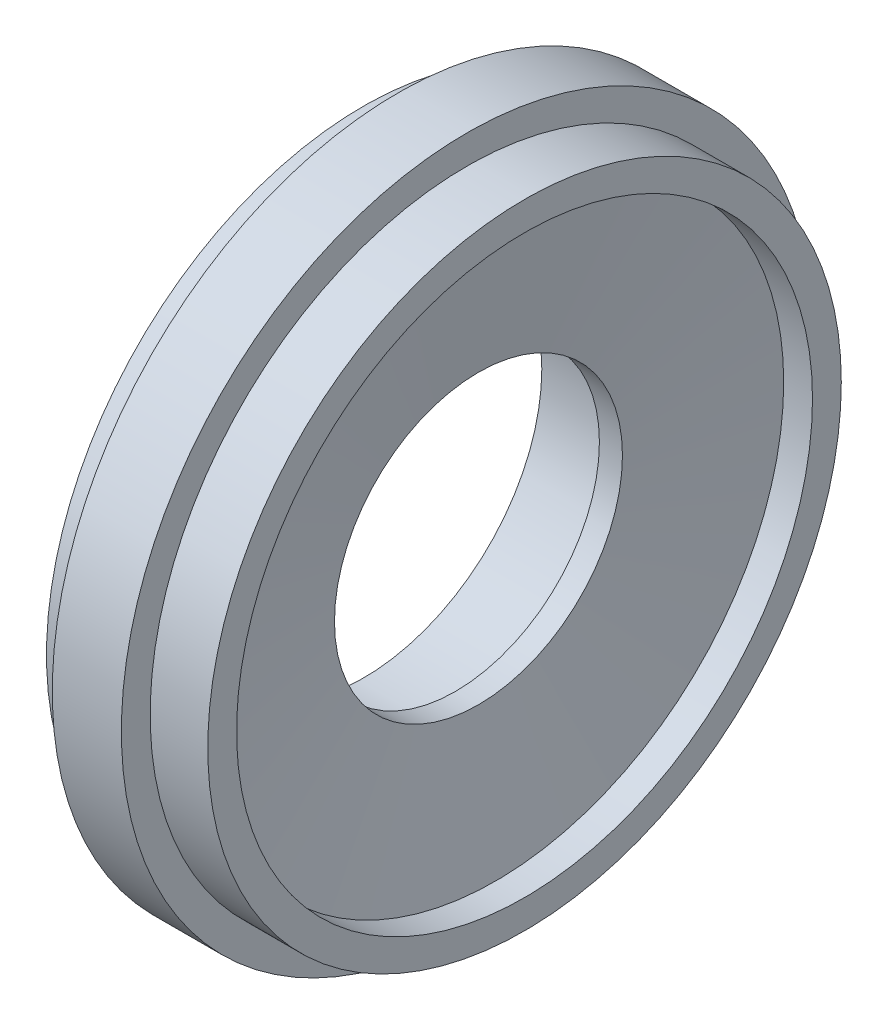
from build123d import *


with BuildPart() as part:
    # Sketch1 → Revolve1 (revolve)
    with BuildSketch(Plane.XY, mode=Mode.PRIVATE) as revolve1_sk:
        Polygon((0, 55), (0, 31), (16, 31), (16, 25), (20, 25), (23, 50), (28, 50), (28, 55), (18, 55), (18, 60), (6, 60), (6, 55), align=None)
    revolve(revolve1_sk.sketch.rotate(Axis((56.926211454, 0, 0), (-1, 0, 0)), 90), axis=Axis((56.926211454, 0, 0), (-1, 0, 0)))


solid = part.part
